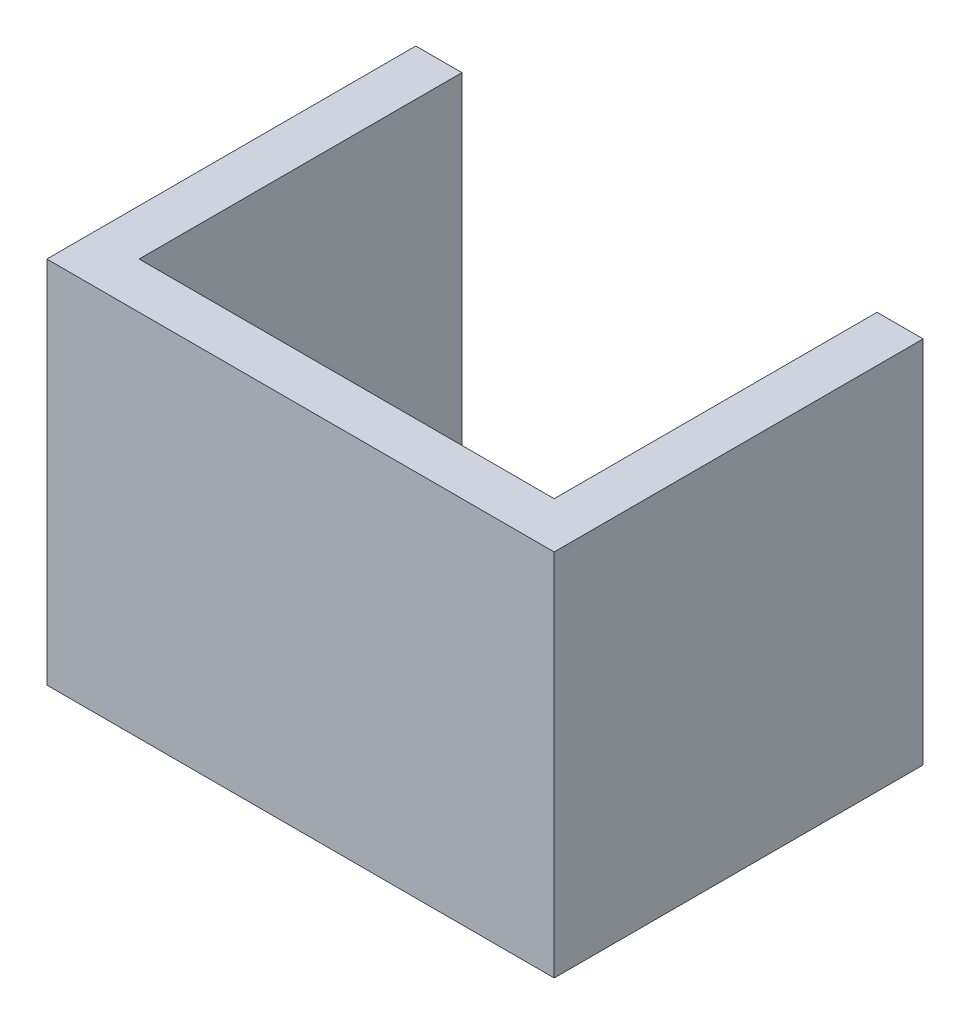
from build123d import *

# Parameters (mm, degrees)
BOSS_EXTRUDE1_DEPTH = 203.2


with BuildPart() as part:
    # Sketch1 → Boss-Extrude1 (new body)
    with BuildSketch(Plane(origin=(0, 0, 0), x_dir=(1, 0, 0), z_dir=(0, 1, 0))):
        Polygon((0, 0), (254, 0), (254, 203.2), (228.6, 203.2), (228.6, 25.4), (0, 25.4), (0, 203.2), (-25.4, 203.2), (-25.4, 0), align=None)
    extrude(amount=BOSS_EXTRUDE1_DEPTH)


solid = part.part
